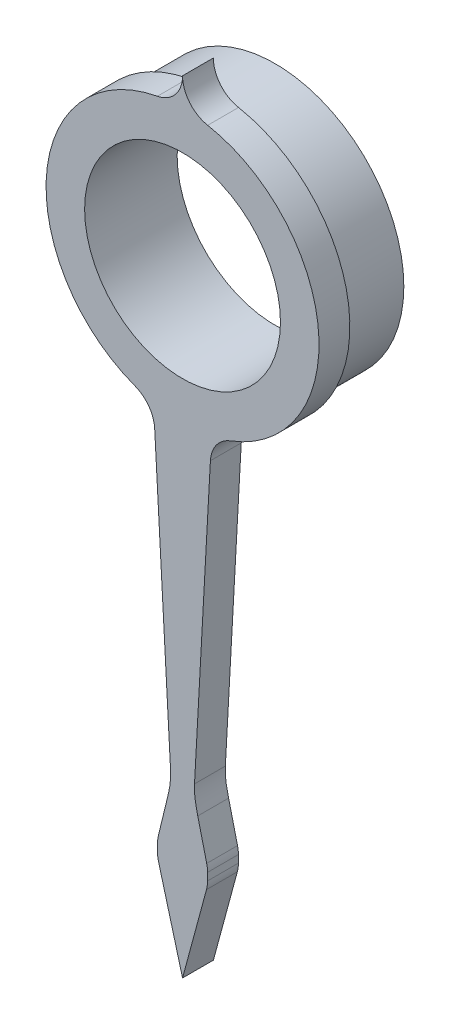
ISO-10303-21;
HEADER;
FILE_DESCRIPTION(('STEP AP214'),'2;1');
FILE_NAME('part.step','',(''),(''),'','','');
FILE_SCHEMA(('AUTOMOTIVE_DESIGN { 1 0 10303 214 1 1 1 1 }'));
ENDSEC;
DATA;
#1=APPLICATION_CONTEXT('core data for automotive mechanical design processes');
#2=APPLICATION_PROTOCOL_DEFINITION('international standard','automotive_design',2000,#1);
#3=PRODUCT_CONTEXT('',#1,'mechanical');
#4=PRODUCT('Part','Part','',(#3));
#5=PRODUCT_RELATED_PRODUCT_CATEGORY('part','',(#4));
#6=PRODUCT_DEFINITION_FORMATION('','',#4);
#7=PRODUCT_DEFINITION_CONTEXT('part definition',#1,'design');
#8=PRODUCT_DEFINITION('design','',#6,#7);
#9=PRODUCT_DEFINITION_SHAPE('','',#8);
#10=(LENGTH_UNIT() NAMED_UNIT(*) SI_UNIT(.MILLI.,.METRE.));
#11=(NAMED_UNIT(*) PLANE_ANGLE_UNIT() SI_UNIT($,.RADIAN.));
#12=(NAMED_UNIT(*) SI_UNIT($,.STERADIAN.) SOLID_ANGLE_UNIT());
#13=UNCERTAINTY_MEASURE_WITH_UNIT(LENGTH_MEASURE(1.E-05),#10,'distance_accuracy_value','');
#14=(GEOMETRIC_REPRESENTATION_CONTEXT(3) GLOBAL_UNCERTAINTY_ASSIGNED_CONTEXT((#13)) GLOBAL_UNIT_ASSIGNED_CONTEXT((#10,
#11,#12)) REPRESENTATION_CONTEXT('',''));
#15=CARTESIAN_POINT('',(0.,0.,0.));
#16=DIRECTION('',(0.,0.,1.));
#17=DIRECTION('',(1.,0.,0.));
#18=AXIS2_PLACEMENT_3D('',#15,#16,#17);
#19=CARTESIAN_POINT('',(1.9017074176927,2.79553884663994,0.));
#20=DIRECTION('',(0.,0.,-1.));
#21=DIRECTION('',(-1.,0.,0.));
#22=AXIS2_PLACEMENT_3D('',#19,#20,#21);
#23=PLANE('',#22);
#24=CARTESIAN_POINT('',(1.9017074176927,2.79553884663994,0.));
#25=DIRECTION('',(0.,0.,-1.));
#26=DIRECTION('',(-1.,0.,0.));
#27=AXIS2_PLACEMENT_3D('',#24,#25,#26);
#28=CIRCLE('',#27,1.);
#29=CARTESIAN_POINT('',(0.903227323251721,2.85065237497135,0.));
#30=VERTEX_POINT('',#29);
#31=CARTESIAN_POINT('',(1.55116227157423,3.73208468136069,0.));
#32=VERTEX_POINT('',#31);
#33=EDGE_CURVE('E353',#30,#32,#28,.T.);
#34=ORIENTED_EDGE('',*,*,#33,.F.);
#35=DIRECTION('',(0.0551135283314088,0.998480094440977,0.));
#36=VECTOR('',#35,1.);
#37=CARTESIAN_POINT('',(0.3881,-6.4818,0.));
#38=LINE('',#37,#36);
#39=CARTESIAN_POINT('',(0.3881,-6.4818,0.));
#40=VERTEX_POINT('',#39);
#41=EDGE_CURVE('E118',#40,#30,#38,.T.);
#42=ORIENTED_EDGE('',*,*,#41,.F.);
#43=CARTESIAN_POINT('',(0.4939,-7.3285,0.));
#44=CARTESIAN_POINT('',(0.424635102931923,-7.04376127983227,0.));
#45=CARTESIAN_POINT('',(0.37105819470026,-6.79054276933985,0.));
#46=CARTESIAN_POINT('',(0.3881,-6.4818,0.));
#47=B_SPLINE_CURVE_WITH_KNOTS('',3,(#43,#44,#45,#46),.UNSPECIFIED.,.F.,.F.,(4,4),(0.,1.),.UNSPECIFIED.);
#48=CARTESIAN_POINT('',(0.4939,-7.3285,0.));
#49=VERTEX_POINT('',#48);
#50=EDGE_CURVE('E112',#49,#40,#47,.T.);
#51=ORIENTED_EDGE('',*,*,#50,.F.);
#52=DIRECTION('',(-0.236364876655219,0.971664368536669,0.));
#53=VECTOR('',#52,1.);
#54=CARTESIAN_POINT('',(0.783064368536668,-8.51721601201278,0.));
#55=LINE('',#54,#53);
#56=CARTESIAN_POINT('',(0.783064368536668,-8.51721601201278,0.));
#57=VERTEX_POINT('',#56);
#58=EDGE_CURVE('E190',#57,#49,#55,.T.);
#59=ORIENTED_EDGE('',*,*,#58,.F.);
#60=CARTESIAN_POINT('',(-0.1886,-8.75358088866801,0.));
#61=DIRECTION('',(0.,0.,1.));
#62=DIRECTION('',(1.,0.,0.));
#63=AXIS2_PLACEMENT_3D('',#60,#61,#62);
#64=CIRCLE('',#63,1.);
#65=CARTESIAN_POINT('',(0.8114,-8.75358088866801,0.));
#66=VERTEX_POINT('',#65);
#67=EDGE_CURVE('E295',#66,#57,#64,.T.);
#68=ORIENTED_EDGE('',*,*,#67,.F.);
#69=DIRECTION('',(0.,1.,0.));
#70=VECTOR('',#69,1.);
#71=CARTESIAN_POINT('',(0.8114,-8.75358088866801,0.));
#72=LINE('',#71,#70);
#73=CARTESIAN_POINT('',(0.8114,-8.99469770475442,0.));
#74=VERTEX_POINT('',#73);
#75=EDGE_CURVE('E291',#74,#66,#72,.T.);
#76=ORIENTED_EDGE('',*,*,#75,.F.);
#77=CARTESIAN_POINT('',(-0.1886,-8.99469770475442,0.));
#78=DIRECTION('',(0.,0.,1.));
#79=DIRECTION('',(1.,0.,0.));
#80=AXIS2_PLACEMENT_3D('',#77,#78,#79);
#81=CIRCLE('',#80,1.);
#82=CARTESIAN_POINT('',(0.776687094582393,-9.25588887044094,0.));
#83=VERTEX_POINT('',#82);
#84=EDGE_CURVE('E380',#83,#74,#81,.T.);
#85=ORIENTED_EDGE('',*,*,#84,.F.);
#86=DIRECTION('',(0.261191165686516,0.965287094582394,0.));
#87=VECTOR('',#86,1.);
#88=CARTESIAN_POINT('',(0.,-12.1263,0.));
#89=LINE('',#88,#87);
#90=CARTESIAN_POINT('',(0.,-12.1263,0.));
#91=VERTEX_POINT('',#90);
#92=EDGE_CURVE('E378',#91,#83,#89,.T.);
#93=ORIENTED_EDGE('',*,*,#92,.F.);
#94=DIRECTION('',(0.261191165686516,-0.965287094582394,0.));
#95=VECTOR('',#94,1.);
#96=CARTESIAN_POINT('',(0.,-12.1263,0.));
#97=LINE('',#96,#95);
#98=CARTESIAN_POINT('',(-0.776687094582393,-9.25588887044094,0.));
#99=VERTEX_POINT('',#98);
#100=EDGE_CURVE('E376',#99,#91,#97,.T.);
#101=ORIENTED_EDGE('',*,*,#100,.F.);
#102=CARTESIAN_POINT('',(0.1886,-8.99469770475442,0.));
#103=DIRECTION('',(0.,0.,1.));
#104=DIRECTION('',(-1.,0.,0.));
#105=AXIS2_PLACEMENT_3D('',#102,#103,#104);
#106=CIRCLE('',#105,1.);
#107=CARTESIAN_POINT('',(-0.8114,-8.99469770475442,0.));
#108=VERTEX_POINT('',#107);
#109=EDGE_CURVE('E374',#108,#99,#106,.T.);
#110=ORIENTED_EDGE('',*,*,#109,.F.);
#111=DIRECTION('',(0.,-1.,0.));
#112=VECTOR('',#111,1.);
#113=CARTESIAN_POINT('',(-0.8114,-8.75358088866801,0.));
#114=LINE('',#113,#112);
#115=CARTESIAN_POINT('',(-0.8114,-8.75358088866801,0.));
#116=VERTEX_POINT('',#115);
#117=EDGE_CURVE('E372',#116,#108,#114,.T.);
#118=ORIENTED_EDGE('',*,*,#117,.F.);
#119=CARTESIAN_POINT('',(0.1886,-8.75358088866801,0.));
#120=DIRECTION('',(0.,0.,1.));
#121=DIRECTION('',(-1.,0.,0.));
#122=AXIS2_PLACEMENT_3D('',#119,#120,#121);
#123=CIRCLE('',#122,1.);
#124=CARTESIAN_POINT('',(-0.783064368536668,-8.51721601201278,0.));
#125=VERTEX_POINT('',#124);
#126=EDGE_CURVE('E370',#125,#116,#123,.T.);
#127=ORIENTED_EDGE('',*,*,#126,.F.);
#128=DIRECTION('',(-0.236364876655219,-0.971664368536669,0.));
#129=VECTOR('',#128,1.);
#130=CARTESIAN_POINT('',(-0.783064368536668,-8.51721601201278,0.));
#131=LINE('',#130,#129);
#132=CARTESIAN_POINT('',(-0.4939,-7.3285,0.));
#133=VERTEX_POINT('',#132);
#134=EDGE_CURVE('E365',#133,#125,#131,.T.);
#135=ORIENTED_EDGE('',*,*,#134,.F.);
#136=CARTESIAN_POINT('',(-0.388099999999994,-6.4818,0.));
#137=CARTESIAN_POINT('',(-0.371058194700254,-6.79054276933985,0.));
#138=CARTESIAN_POINT('',(-0.424635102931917,-7.04376127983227,0.));
#139=CARTESIAN_POINT('',(-0.493899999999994,-7.3285,0.));
#140=B_SPLINE_CURVE_WITH_KNOTS('',3,(#136,#137,#138,#139),.UNSPECIFIED.,.F.,.F.,(4,4),(0.,1.),.UNSPECIFIED.);
#141=CARTESIAN_POINT('',(-0.388099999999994,-6.4818,0.));
#142=VERTEX_POINT('',#141);
#143=EDGE_CURVE('E361',#142,#133,#140,.T.);
#144=ORIENTED_EDGE('',*,*,#143,.F.);
#145=DIRECTION('',(0.0551135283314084,-0.998480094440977,0.));
#146=VECTOR('',#145,1.);
#147=CARTESIAN_POINT('',(-0.3881,-6.4818,0.));
#148=LINE('',#147,#146);
#149=CARTESIAN_POINT('',(-0.903227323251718,2.85065237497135,0.));
#150=VERTEX_POINT('',#149);
#151=EDGE_CURVE('E359',#150,#142,#148,.T.);
#152=ORIENTED_EDGE('',*,*,#151,.F.);
#153=CARTESIAN_POINT('',(-1.90170741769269,2.79553884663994,0.));
#154=DIRECTION('',(0.,0.,-1.));
#155=DIRECTION('',(1.,0.,0.));
#156=AXIS2_PLACEMENT_3D('',#153,#154,#155);
#157=CIRCLE('',#156,1.);
#158=CARTESIAN_POINT('',(-1.55116227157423,3.73208468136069,0.));
#159=VERTEX_POINT('',#158);
#160=EDGE_CURVE('E357',#159,#150,#157,.T.);
#161=ORIENTED_EDGE('',*,*,#160,.F.);
#162=CARTESIAN_POINT('',(0.,7.8763,0.));
#163=DIRECTION('',(0.,0.,1.));
#164=DIRECTION('',(1.,0.,0.));
#165=AXIS2_PLACEMENT_3D('',#162,#163,#164);
#166=CIRCLE('',#165,4.425);
#167=CARTESIAN_POINT('',(-0.815668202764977,12.2254735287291,0.));
#168=VERTEX_POINT('',#167);
#169=EDGE_CURVE('E351',#168,#159,#166,.T.);
#170=ORIENTED_EDGE('',*,*,#169,.F.);
#171=CARTESIAN_POINT('',(-1.,13.2083376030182,0.));
#172=DIRECTION('',(0.,0.,-1.));
#173=DIRECTION('',(-1.,0.,0.));
#174=AXIS2_PLACEMENT_3D('',#171,#172,#173);
#175=CIRCLE('',#174,1.);
#176=CARTESIAN_POINT('',(0.,13.2083376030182,0.));
#177=VERTEX_POINT('',#176);
#178=EDGE_CURVE('E349',#177,#168,#175,.T.);
#179=ORIENTED_EDGE('',*,*,#178,.F.);
#180=CARTESIAN_POINT('',(1.,13.2083376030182,0.));
#181=DIRECTION('',(0.,0.,-1.));
#182=DIRECTION('',(1.,0.,0.));
#183=AXIS2_PLACEMENT_3D('',#180,#181,#182);
#184=CIRCLE('',#183,1.);
#185=CARTESIAN_POINT('',(0.815668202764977,12.2254735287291,0.));
#186=VERTEX_POINT('',#185);
#187=EDGE_CURVE('E341',#186,#177,#184,.T.);
#188=ORIENTED_EDGE('',*,*,#187,.F.);
#189=CARTESIAN_POINT('',(0.,7.8763,0.));
#190=DIRECTION('',(0.,0.,1.));
#191=DIRECTION('',(1.,0.,0.));
#192=AXIS2_PLACEMENT_3D('',#189,#190,#191);
#193=CIRCLE('',#192,4.425);
#194=EDGE_CURVE('E347',#32,#186,#193,.T.);
#195=ORIENTED_EDGE('',*,*,#194,.F.);
#196=EDGE_LOOP('',(#34,#42,#51,#59,#68,#76,#85,#93,#101,#110,#118,#127,#135,#144,#152,#161,#170,
#179,#188,#195));
#197=FACE_BOUND('',#196,.T.);
#198=CARTESIAN_POINT('',(0.,7.8763,0.));
#199=DIRECTION('',(0.,0.,-1.));
#200=DIRECTION('',(-1.,0.,0.));
#201=AXIS2_PLACEMENT_3D('',#198,#199,#200);
#202=CIRCLE('',#201,4.175);
#203=CARTESIAN_POINT('',(-4.175,7.8763,0.));
#204=VERTEX_POINT('',#203);
#205=EDGE_CURVE('E403',#204,#204,#202,.T.);
#206=ORIENTED_EDGE('',*,*,#205,.F.);
#207=EDGE_LOOP('',(#206));
#208=FACE_BOUND('',#207,.T.);
#209=ADVANCED_FACE('F30',(#197,#208),#23,.T.);
#210=CARTESIAN_POINT('',(1.9017074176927,2.79553884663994,1.));
#211=DIRECTION('',(0.,0.,-1.));
#212=DIRECTION('',(-1.,0.,0.));
#213=AXIS2_PLACEMENT_3D('',#210,#211,#212);
#214=PLANE('',#213);
#215=CARTESIAN_POINT('',(1.9017074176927,2.79553884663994,1.));
#216=DIRECTION('',(0.,0.,-1.));
#217=DIRECTION('',(-1.,0.,0.));
#218=AXIS2_PLACEMENT_3D('',#215,#216,#217);
#219=CIRCLE('',#218,1.);
#220=CARTESIAN_POINT('',(0.903227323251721,2.85065237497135,1.));
#221=VERTEX_POINT('',#220);
#222=CARTESIAN_POINT('',(1.55116227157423,3.73208468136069,1.));
#223=VERTEX_POINT('',#222);
#224=EDGE_CURVE('E392',#221,#223,#219,.T.);
#225=ORIENTED_EDGE('',*,*,#224,.T.);
#226=CARTESIAN_POINT('',(0.,7.8763,1.));
#227=DIRECTION('',(0.,0.,1.));
#228=DIRECTION('',(1.,0.,0.));
#229=AXIS2_PLACEMENT_3D('',#226,#227,#228);
#230=CIRCLE('',#229,4.425);
#231=CARTESIAN_POINT('',(0.815668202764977,12.2254735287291,1.));
#232=VERTEX_POINT('',#231);
#233=EDGE_CURVE('E126',#223,#232,#230,.T.);
#234=ORIENTED_EDGE('',*,*,#233,.T.);
#235=CARTESIAN_POINT('',(1.,13.2083376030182,1.));
#236=DIRECTION('',(0.,0.,-1.));
#237=DIRECTION('',(1.,0.,0.));
#238=AXIS2_PLACEMENT_3D('',#235,#236,#237);
#239=CIRCLE('',#238,1.);
#240=CARTESIAN_POINT('',(0.,13.2083376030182,1.));
#241=VERTEX_POINT('',#240);
#242=EDGE_CURVE('E342',#232,#241,#239,.T.);
#243=ORIENTED_EDGE('',*,*,#242,.T.);
#244=CARTESIAN_POINT('',(-1.,13.2083376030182,1.));
#245=DIRECTION('',(0.,0.,-1.));
#246=DIRECTION('',(-1.,0.,0.));
#247=AXIS2_PLACEMENT_3D('',#244,#245,#246);
#248=CIRCLE('',#247,1.);
#249=CARTESIAN_POINT('',(-0.815668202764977,12.2254735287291,1.));
#250=VERTEX_POINT('',#249);
#251=EDGE_CURVE('E410',#241,#250,#248,.T.);
#252=ORIENTED_EDGE('',*,*,#251,.T.);
#253=CARTESIAN_POINT('',(0.,7.8763,1.));
#254=DIRECTION('',(0.,0.,1.));
#255=DIRECTION('',(1.,0.,0.));
#256=AXIS2_PLACEMENT_3D('',#253,#254,#255);
#257=CIRCLE('',#256,4.425);
#258=CARTESIAN_POINT('',(-1.55116227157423,3.73208468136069,1.));
#259=VERTEX_POINT('',#258);
#260=EDGE_CURVE('E412',#250,#259,#257,.T.);
#261=ORIENTED_EDGE('',*,*,#260,.T.);
#262=CARTESIAN_POINT('',(-1.90170741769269,2.79553884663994,1.));
#263=DIRECTION('',(0.,0.,-1.));
#264=DIRECTION('',(1.,0.,0.));
#265=AXIS2_PLACEMENT_3D('',#262,#263,#264);
#266=CIRCLE('',#265,1.);
#267=CARTESIAN_POINT('',(-0.903227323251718,2.85065237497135,1.));
#268=VERTEX_POINT('',#267);
#269=EDGE_CURVE('E413',#259,#268,#266,.T.);
#270=ORIENTED_EDGE('',*,*,#269,.T.);
#271=DIRECTION('',(0.0551135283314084,-0.998480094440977,0.));
#272=VECTOR('',#271,1.);
#273=CARTESIAN_POINT('',(-0.3881,-6.4818,1.));
#274=LINE('',#273,#272);
#275=CARTESIAN_POINT('',(-0.388099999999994,-6.4818,1.));
#276=VERTEX_POINT('',#275);
#277=EDGE_CURVE('E264',#268,#276,#274,.T.);
#278=ORIENTED_EDGE('',*,*,#277,.T.);
#279=CARTESIAN_POINT('',(-0.388099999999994,-6.4818,1.));
#280=CARTESIAN_POINT('',(-0.371058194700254,-6.79054276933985,1.));
#281=CARTESIAN_POINT('',(-0.424635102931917,-7.04376127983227,1.));
#282=CARTESIAN_POINT('',(-0.493899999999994,-7.3285,1.));
#283=B_SPLINE_CURVE_WITH_KNOTS('',3,(#279,#280,#281,#282),.UNSPECIFIED.,.F.,.F.,(4,4),(0.,1.),.UNSPECIFIED.);
#284=CARTESIAN_POINT('',(-0.4939,-7.3285,1.));
#285=VERTEX_POINT('',#284);
#286=EDGE_CURVE('E257',#276,#285,#283,.T.);
#287=ORIENTED_EDGE('',*,*,#286,.T.);
#288=DIRECTION('',(-0.236364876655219,-0.971664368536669,0.));
#289=VECTOR('',#288,1.);
#290=CARTESIAN_POINT('',(-0.783064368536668,-8.51721601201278,1.));
#291=LINE('',#290,#289);
#292=CARTESIAN_POINT('',(-0.783064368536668,-8.51721601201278,1.));
#293=VERTEX_POINT('',#292);
#294=EDGE_CURVE('E263',#285,#293,#291,.T.);
#295=ORIENTED_EDGE('',*,*,#294,.T.);
#296=CARTESIAN_POINT('',(0.1886,-8.75358088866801,1.));
#297=DIRECTION('',(0.,0.,1.));
#298=DIRECTION('',(-1.,0.,0.));
#299=AXIS2_PLACEMENT_3D('',#296,#297,#298);
#300=CIRCLE('',#299,1.);
#301=CARTESIAN_POINT('',(-0.8114,-8.75358088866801,1.));
#302=VERTEX_POINT('',#301);
#303=EDGE_CURVE('E270',#293,#302,#300,.T.);
#304=ORIENTED_EDGE('',*,*,#303,.T.);
#305=DIRECTION('',(0.,-1.,0.));
#306=VECTOR('',#305,1.);
#307=CARTESIAN_POINT('',(-0.8114,-8.75358088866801,1.));
#308=LINE('',#307,#306);
#309=CARTESIAN_POINT('',(-0.8114,-8.99469770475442,1.));
#310=VERTEX_POINT('',#309);
#311=EDGE_CURVE('E272',#302,#310,#308,.T.);
#312=ORIENTED_EDGE('',*,*,#311,.T.);
#313=CARTESIAN_POINT('',(0.1886,-8.99469770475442,1.));
#314=DIRECTION('',(0.,0.,1.));
#315=DIRECTION('',(-1.,0.,0.));
#316=AXIS2_PLACEMENT_3D('',#313,#314,#315);
#317=CIRCLE('',#316,1.);
#318=CARTESIAN_POINT('',(-0.776687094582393,-9.25588887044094,1.));
#319=VERTEX_POINT('',#318);
#320=EDGE_CURVE('E274',#310,#319,#317,.T.);
#321=ORIENTED_EDGE('',*,*,#320,.T.);
#322=DIRECTION('',(0.261191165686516,-0.965287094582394,0.));
#323=VECTOR('',#322,1.);
#324=CARTESIAN_POINT('',(0.,-12.1263,1.));
#325=LINE('',#324,#323);
#326=CARTESIAN_POINT('',(0.,-12.1263,1.));
#327=VERTEX_POINT('',#326);
#328=EDGE_CURVE('E276',#319,#327,#325,.T.);
#329=ORIENTED_EDGE('',*,*,#328,.T.);
#330=DIRECTION('',(0.261191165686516,0.965287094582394,0.));
#331=VECTOR('',#330,1.);
#332=CARTESIAN_POINT('',(0.,-12.1263,1.));
#333=LINE('',#332,#331);
#334=CARTESIAN_POINT('',(0.776687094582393,-9.25588887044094,1.));
#335=VERTEX_POINT('',#334);
#336=EDGE_CURVE('E278',#327,#335,#333,.T.);
#337=ORIENTED_EDGE('',*,*,#336,.T.);
#338=CARTESIAN_POINT('',(-0.1886,-8.99469770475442,1.));
#339=DIRECTION('',(0.,0.,1.));
#340=DIRECTION('',(1.,0.,0.));
#341=AXIS2_PLACEMENT_3D('',#338,#339,#340);
#342=CIRCLE('',#341,1.);
#343=CARTESIAN_POINT('',(0.8114,-8.99469770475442,1.));
#344=VERTEX_POINT('',#343);
#345=EDGE_CURVE('E280',#335,#344,#342,.T.);
#346=ORIENTED_EDGE('',*,*,#345,.T.);
#347=DIRECTION('',(0.,1.,0.));
#348=VECTOR('',#347,1.);
#349=CARTESIAN_POINT('',(0.8114,-8.75358088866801,1.));
#350=LINE('',#349,#348);
#351=CARTESIAN_POINT('',(0.8114,-8.75358088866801,1.));
#352=VERTEX_POINT('',#351);
#353=EDGE_CURVE('E282',#344,#352,#350,.T.);
#354=ORIENTED_EDGE('',*,*,#353,.T.);
#355=CARTESIAN_POINT('',(-0.1886,-8.75358088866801,1.));
#356=DIRECTION('',(0.,0.,1.));
#357=DIRECTION('',(1.,0.,0.));
#358=AXIS2_PLACEMENT_3D('',#355,#356,#357);
#359=CIRCLE('',#358,1.);
#360=CARTESIAN_POINT('',(0.783064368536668,-8.51721601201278,1.));
#361=VERTEX_POINT('',#360);
#362=EDGE_CURVE('E182',#352,#361,#359,.T.);
#363=ORIENTED_EDGE('',*,*,#362,.T.);
#364=DIRECTION('',(-0.236364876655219,0.971664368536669,0.));
#365=VECTOR('',#364,1.);
#366=CARTESIAN_POINT('',(0.783064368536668,-8.51721601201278,1.));
#367=LINE('',#366,#365);
#368=CARTESIAN_POINT('',(0.4939,-7.3285,1.));
#369=VERTEX_POINT('',#368);
#370=EDGE_CURVE('E175',#361,#369,#367,.T.);
#371=ORIENTED_EDGE('',*,*,#370,.T.);
#372=CARTESIAN_POINT('',(0.4939,-7.3285,1.));
#373=CARTESIAN_POINT('',(0.424635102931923,-7.04376127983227,1.));
#374=CARTESIAN_POINT('',(0.37105819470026,-6.79054276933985,1.));
#375=CARTESIAN_POINT('',(0.3881,-6.4818,1.));
#376=B_SPLINE_CURVE_WITH_KNOTS('',3,(#372,#373,#374,#375),.UNSPECIFIED.,.F.,.F.,(4,4),(0.,1.),.UNSPECIFIED.);
#377=CARTESIAN_POINT('',(0.3881,-6.4818,1.));
#378=VERTEX_POINT('',#377);
#379=EDGE_CURVE('E180',#369,#378,#376,.T.);
#380=ORIENTED_EDGE('',*,*,#379,.T.);
#381=DIRECTION('',(0.0551135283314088,0.998480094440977,0.));
#382=VECTOR('',#381,1.);
#383=CARTESIAN_POINT('',(0.3881,-6.4818,1.));
#384=LINE('',#383,#382);
#385=EDGE_CURVE('E47',#378,#221,#384,.T.);
#386=ORIENTED_EDGE('',*,*,#385,.T.);
#387=EDGE_LOOP('',(#225,#234,#243,#252,#261,#270,#278,#287,#295,#304,#312,#321,#329,#337,#346,
#354,#363,#371,#380,#386));
#388=FACE_BOUND('',#387,.T.);
#389=CARTESIAN_POINT('',(0.,7.8763,1.));
#390=DIRECTION('',(0.,0.,1.));
#391=DIRECTION('',(1.,0.,0.));
#392=AXIS2_PLACEMENT_3D('',#389,#390,#391);
#393=CIRCLE('',#392,3.175);
#394=CARTESIAN_POINT('',(3.175,7.8763,1.));
#395=VERTEX_POINT('',#394);
#396=EDGE_CURVE('E396',#395,#395,#393,.T.);
#397=ORIENTED_EDGE('',*,*,#396,.F.);
#398=EDGE_LOOP('',(#397));
#399=FACE_BOUND('',#398,.T.);
#400=ADVANCED_FACE('F177',(#388,#399),#214,.F.);
#401=CARTESIAN_POINT('',(1.9017074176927,2.79553884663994,1.));
#402=DIRECTION('',(0.,0.,-1.));
#403=DIRECTION('',(-1.,0.,0.));
#404=AXIS2_PLACEMENT_3D('',#401,#402,#403);
#405=CYLINDRICAL_SURFACE('',#404,1.);
#406=ORIENTED_EDGE('',*,*,#33,.T.);
#407=DIRECTION('',(0.,0.,-1.));
#408=VECTOR('',#407,1.);
#409=CARTESIAN_POINT('',(1.55116227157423,3.73208468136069,1.));
#410=LINE('',#409,#408);
#411=EDGE_CURVE('E11',#223,#32,#410,.T.);
#412=ORIENTED_EDGE('',*,*,#411,.F.);
#413=ORIENTED_EDGE('',*,*,#224,.F.);
#414=DIRECTION('',(0.,0.,-1.));
#415=VECTOR('',#414,1.);
#416=CARTESIAN_POINT('',(0.903227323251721,2.85065237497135,1.));
#417=LINE('',#416,#415);
#418=EDGE_CURVE('E196',#221,#30,#417,.T.);
#419=ORIENTED_EDGE('',*,*,#418,.T.);
#420=EDGE_LOOP('',(#406,#412,#413,#419));
#421=FACE_BOUND('',#420,.T.);
#422=ADVANCED_FACE('F32',(#421),#405,.F.);
#423=CARTESIAN_POINT('',(0.,7.8763,1.));
#424=DIRECTION('',(0.,0.,-1.));
#425=DIRECTION('',(-1.,0.,0.));
#426=AXIS2_PLACEMENT_3D('',#423,#424,#425);
#427=CYLINDRICAL_SURFACE('',#426,4.425);
#428=ORIENTED_EDGE('',*,*,#194,.T.);
#429=DIRECTION('',(0.,0.,-1.));
#430=VECTOR('',#429,1.);
#431=CARTESIAN_POINT('',(0.815668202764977,12.2254735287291,1.));
#432=LINE('',#431,#430);
#433=EDGE_CURVE('E39',#232,#186,#432,.T.);
#434=ORIENTED_EDGE('',*,*,#433,.F.);
#435=ORIENTED_EDGE('',*,*,#233,.F.);
#436=ORIENTED_EDGE('',*,*,#411,.T.);
#437=EDGE_LOOP('',(#428,#434,#435,#436));
#438=FACE_BOUND('',#437,.T.);
#439=ADVANCED_FACE('F454',(#438),#427,.T.);
#440=CARTESIAN_POINT('',(1.,13.2083376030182,1.));
#441=DIRECTION('',(0.,0.,-1.));
#442=DIRECTION('',(-1.,0.,0.));
#443=AXIS2_PLACEMENT_3D('',#440,#441,#442);
#444=CYLINDRICAL_SURFACE('',#443,1.);
#445=ORIENTED_EDGE('',*,*,#187,.T.);
#446=DIRECTION('',(0.,0.,-1.));
#447=VECTOR('',#446,1.);
#448=CARTESIAN_POINT('',(0.,13.2083376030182,1.));
#449=LINE('',#448,#447);
#450=EDGE_CURVE('E333',#241,#177,#449,.T.);
#451=ORIENTED_EDGE('',*,*,#450,.F.);
#452=ORIENTED_EDGE('',*,*,#242,.F.);
#453=ORIENTED_EDGE('',*,*,#433,.T.);
#454=EDGE_LOOP('',(#445,#451,#452,#453));
#455=FACE_BOUND('',#454,.T.);
#456=ADVANCED_FACE('F339',(#455),#444,.F.);
#457=CARTESIAN_POINT('',(-1.,13.2083376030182,1.));
#458=DIRECTION('',(0.,0.,-1.));
#459=DIRECTION('',(-1.,0.,0.));
#460=AXIS2_PLACEMENT_3D('',#457,#458,#459);
#461=CYLINDRICAL_SURFACE('',#460,1.);
#462=ORIENTED_EDGE('',*,*,#178,.T.);
#463=DIRECTION('',(0.,0.,-1.));
#464=VECTOR('',#463,1.);
#465=CARTESIAN_POINT('',(-0.815668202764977,12.2254735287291,1.));
#466=LINE('',#465,#464);
#467=EDGE_CURVE('E330',#250,#168,#466,.T.);
#468=ORIENTED_EDGE('',*,*,#467,.F.);
#469=ORIENTED_EDGE('',*,*,#251,.F.);
#470=ORIENTED_EDGE('',*,*,#450,.T.);
#471=EDGE_LOOP('',(#462,#468,#469,#470));
#472=FACE_BOUND('',#471,.T.);
#473=ADVANCED_FACE('F452',(#472),#461,.F.);
#474=CARTESIAN_POINT('',(0.,7.8763,1.));
#475=DIRECTION('',(0.,0.,-1.));
#476=DIRECTION('',(-1.,0.,0.));
#477=AXIS2_PLACEMENT_3D('',#474,#475,#476);
#478=CYLINDRICAL_SURFACE('',#477,4.425);
#479=ORIENTED_EDGE('',*,*,#169,.T.);
#480=DIRECTION('',(0.,0.,-1.));
#481=VECTOR('',#480,1.);
#482=CARTESIAN_POINT('',(-1.55116227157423,3.73208468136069,1.));
#483=LINE('',#482,#481);
#484=EDGE_CURVE('E327',#259,#159,#483,.T.);
#485=ORIENTED_EDGE('',*,*,#484,.F.);
#486=ORIENTED_EDGE('',*,*,#260,.F.);
#487=ORIENTED_EDGE('',*,*,#467,.T.);
#488=EDGE_LOOP('',(#479,#485,#486,#487));
#489=FACE_BOUND('',#488,.T.);
#490=ADVANCED_FACE('F448',(#489),#478,.T.);
#491=CARTESIAN_POINT('',(-1.90170741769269,2.79553884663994,1.));
#492=DIRECTION('',(0.,0.,-1.));
#493=DIRECTION('',(-1.,0.,0.));
#494=AXIS2_PLACEMENT_3D('',#491,#492,#493);
#495=CYLINDRICAL_SURFACE('',#494,1.);
#496=ORIENTED_EDGE('',*,*,#160,.T.);
#497=DIRECTION('',(0.,0.,-1.));
#498=VECTOR('',#497,1.);
#499=CARTESIAN_POINT('',(-0.903227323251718,2.85065237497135,1.));
#500=LINE('',#499,#498);
#501=EDGE_CURVE('E324',#268,#150,#500,.T.);
#502=ORIENTED_EDGE('',*,*,#501,.F.);
#503=ORIENTED_EDGE('',*,*,#269,.F.);
#504=ORIENTED_EDGE('',*,*,#484,.T.);
#505=EDGE_LOOP('',(#496,#502,#503,#504));
#506=FACE_BOUND('',#505,.T.);
#507=ADVANCED_FACE('F444',(#506),#495,.F.);
#508=CARTESIAN_POINT('',(-0.3881,-6.4818,1.));
#509=DIRECTION('',(0.998480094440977,0.0551135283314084,0.));
#510=DIRECTION('',(-0.0551135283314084,0.998480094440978,0.));
#511=AXIS2_PLACEMENT_3D('',#508,#509,#510);
#512=PLANE('',#511);
#513=ORIENTED_EDGE('',*,*,#151,.T.);
#514=DIRECTION('',(0.,0.,-1.));
#515=VECTOR('',#514,1.);
#516=CARTESIAN_POINT('',(-0.388099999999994,-6.4818,1.));
#517=LINE('',#516,#515);
#518=EDGE_CURVE('E321',#276,#142,#517,.T.);
#519=ORIENTED_EDGE('',*,*,#518,.F.);
#520=ORIENTED_EDGE('',*,*,#277,.F.);
#521=ORIENTED_EDGE('',*,*,#501,.T.);
#522=EDGE_LOOP('',(#513,#519,#520,#521));
#523=FACE_BOUND('',#522,.T.);
#524=ADVANCED_FACE('F254',(#523),#512,.F.);
#525=DIRECTION('',(0.,0.,-1.));
#526=VECTOR('',#525,1.);
#527=SURFACE_OF_LINEAR_EXTRUSION('',#283,#526);
#528=ORIENTED_EDGE('',*,*,#143,.T.);
#529=DIRECTION('',(0.,0.,-1.));
#530=VECTOR('',#529,1.);
#531=CARTESIAN_POINT('',(-0.4939,-7.3285,1.));
#532=LINE('',#531,#530);
#533=EDGE_CURVE('E318',#285,#133,#532,.T.);
#534=ORIENTED_EDGE('',*,*,#533,.F.);
#535=ORIENTED_EDGE('',*,*,#286,.F.);
#536=ORIENTED_EDGE('',*,*,#518,.T.);
#537=EDGE_LOOP('',(#528,#534,#535,#536));
#538=FACE_BOUND('',#537,.T.);
#539=ADVANCED_FACE('F249',(#538),#527,.F.);
#540=CARTESIAN_POINT('',(-0.783064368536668,-8.51721601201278,1.));
#541=DIRECTION('',(0.971664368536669,-0.236364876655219,0.));
#542=DIRECTION('',(0.236364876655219,0.971664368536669,0.));
#543=AXIS2_PLACEMENT_3D('',#540,#541,#542);
#544=PLANE('',#543);
#545=ORIENTED_EDGE('',*,*,#134,.T.);
#546=DIRECTION('',(0.,0.,-1.));
#547=VECTOR('',#546,1.);
#548=CARTESIAN_POINT('',(-0.783064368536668,-8.51721601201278,1.));
#549=LINE('',#548,#547);
#550=EDGE_CURVE('E315',#293,#125,#549,.T.);
#551=ORIENTED_EDGE('',*,*,#550,.F.);
#552=ORIENTED_EDGE('',*,*,#294,.F.);
#553=ORIENTED_EDGE('',*,*,#533,.T.);
#554=EDGE_LOOP('',(#545,#551,#552,#553));
#555=FACE_BOUND('',#554,.T.);
#556=ADVANCED_FACE('F245',(#555),#544,.F.);
#557=CARTESIAN_POINT('',(0.1886,-8.75358088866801,1.));
#558=DIRECTION('',(0.,0.,-1.));
#559=DIRECTION('',(-1.,0.,0.));
#560=AXIS2_PLACEMENT_3D('',#557,#558,#559);
#561=CYLINDRICAL_SURFACE('',#560,1.);
#562=ORIENTED_EDGE('',*,*,#126,.T.);
#563=DIRECTION('',(0.,0.,-1.));
#564=VECTOR('',#563,1.);
#565=CARTESIAN_POINT('',(-0.8114,-8.75358088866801,1.));
#566=LINE('',#565,#564);
#567=EDGE_CURVE('E312',#302,#116,#566,.T.);
#568=ORIENTED_EDGE('',*,*,#567,.F.);
#569=ORIENTED_EDGE('',*,*,#303,.F.);
#570=ORIENTED_EDGE('',*,*,#550,.T.);
#571=EDGE_LOOP('',(#562,#568,#569,#570));
#572=FACE_BOUND('',#571,.T.);
#573=ADVANCED_FACE('F241',(#572),#561,.T.);
#574=CARTESIAN_POINT('',(-0.8114,-8.75358088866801,1.));
#575=DIRECTION('',(1.,0.,0.));
#576=DIRECTION('',(0.,0.,-1.));
#577=AXIS2_PLACEMENT_3D('',#574,#575,#576);
#578=PLANE('',#577);
#579=ORIENTED_EDGE('',*,*,#117,.T.);
#580=DIRECTION('',(0.,0.,-1.));
#581=VECTOR('',#580,1.);
#582=CARTESIAN_POINT('',(-0.8114,-8.99469770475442,1.));
#583=LINE('',#582,#581);
#584=EDGE_CURVE('E309',#310,#108,#583,.T.);
#585=ORIENTED_EDGE('',*,*,#584,.F.);
#586=ORIENTED_EDGE('',*,*,#311,.F.);
#587=ORIENTED_EDGE('',*,*,#567,.T.);
#588=EDGE_LOOP('',(#579,#585,#586,#587));
#589=FACE_BOUND('',#588,.T.);
#590=ADVANCED_FACE('F237',(#589),#578,.F.);
#591=CARTESIAN_POINT('',(0.1886,-8.99469770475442,1.));
#592=DIRECTION('',(0.,0.,-1.));
#593=DIRECTION('',(-1.,0.,0.));
#594=AXIS2_PLACEMENT_3D('',#591,#592,#593);
#595=CYLINDRICAL_SURFACE('',#594,1.);
#596=ORIENTED_EDGE('',*,*,#109,.T.);
#597=DIRECTION('',(0.,0.,-1.));
#598=VECTOR('',#597,1.);
#599=CARTESIAN_POINT('',(-0.776687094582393,-9.25588887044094,1.));
#600=LINE('',#599,#598);
#601=EDGE_CURVE('E306',#319,#99,#600,.T.);
#602=ORIENTED_EDGE('',*,*,#601,.F.);
#603=ORIENTED_EDGE('',*,*,#320,.F.);
#604=ORIENTED_EDGE('',*,*,#584,.T.);
#605=EDGE_LOOP('',(#596,#602,#603,#604));
#606=FACE_BOUND('',#605,.T.);
#607=ADVANCED_FACE('F233',(#606),#595,.T.);
#608=CARTESIAN_POINT('',(0.,-12.1263,1.));
#609=DIRECTION('',(0.965287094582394,0.261191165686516,0.));
#610=DIRECTION('',(-0.261191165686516,0.965287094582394,0.));
#611=AXIS2_PLACEMENT_3D('',#608,#609,#610);
#612=PLANE('',#611);
#613=ORIENTED_EDGE('',*,*,#100,.T.);
#614=DIRECTION('',(0.,0.,-1.));
#615=VECTOR('',#614,1.);
#616=CARTESIAN_POINT('',(0.,-12.1263,1.));
#617=LINE('',#616,#615);
#618=EDGE_CURVE('E303',#327,#91,#617,.T.);
#619=ORIENTED_EDGE('',*,*,#618,.F.);
#620=ORIENTED_EDGE('',*,*,#328,.F.);
#621=ORIENTED_EDGE('',*,*,#601,.T.);
#622=EDGE_LOOP('',(#613,#619,#620,#621));
#623=FACE_BOUND('',#622,.T.);
#624=ADVANCED_FACE('F229',(#623),#612,.F.);
#625=CARTESIAN_POINT('',(0.,-12.1263,1.));
#626=DIRECTION('',(-0.965287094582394,0.261191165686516,0.));
#627=DIRECTION('',(-0.261191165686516,-0.965287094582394,0.));
#628=AXIS2_PLACEMENT_3D('',#625,#626,#627);
#629=PLANE('',#628);
#630=ORIENTED_EDGE('',*,*,#92,.T.);
#631=DIRECTION('',(0.,0.,-1.));
#632=VECTOR('',#631,1.);
#633=CARTESIAN_POINT('',(0.776687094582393,-9.25588887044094,1.));
#634=LINE('',#633,#632);
#635=EDGE_CURVE('E300',#335,#83,#634,.T.);
#636=ORIENTED_EDGE('',*,*,#635,.F.);
#637=ORIENTED_EDGE('',*,*,#336,.F.);
#638=ORIENTED_EDGE('',*,*,#618,.T.);
#639=EDGE_LOOP('',(#630,#636,#637,#638));
#640=FACE_BOUND('',#639,.T.);
#641=ADVANCED_FACE('F225',(#640),#629,.F.);
#642=CARTESIAN_POINT('',(-0.1886,-8.99469770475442,1.));
#643=DIRECTION('',(0.,0.,-1.));
#644=DIRECTION('',(-1.,0.,0.));
#645=AXIS2_PLACEMENT_3D('',#642,#643,#644);
#646=CYLINDRICAL_SURFACE('',#645,1.);
#647=ORIENTED_EDGE('',*,*,#84,.T.);
#648=DIRECTION('',(0.,0.,-1.));
#649=VECTOR('',#648,1.);
#650=CARTESIAN_POINT('',(0.8114,-8.99469770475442,1.));
#651=LINE('',#650,#649);
#652=EDGE_CURVE('E293',#344,#74,#651,.T.);
#653=ORIENTED_EDGE('',*,*,#652,.F.);
#654=ORIENTED_EDGE('',*,*,#345,.F.);
#655=ORIENTED_EDGE('',*,*,#635,.T.);
#656=EDGE_LOOP('',(#647,#653,#654,#655));
#657=FACE_BOUND('',#656,.T.);
#658=ADVANCED_FACE('F221',(#657),#646,.T.);
#659=CARTESIAN_POINT('',(0.8114,-8.75358088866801,1.));
#660=DIRECTION('',(-1.,0.,0.));
#661=DIRECTION('',(0.,0.,1.));
#662=AXIS2_PLACEMENT_3D('',#659,#660,#661);
#663=PLANE('',#662);
#664=ORIENTED_EDGE('',*,*,#75,.T.);
#665=DIRECTION('',(0.,0.,-1.));
#666=VECTOR('',#665,1.);
#667=CARTESIAN_POINT('',(0.8114,-8.75358088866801,1.));
#668=LINE('',#667,#666);
#669=EDGE_CURVE('E289',#352,#66,#668,.T.);
#670=ORIENTED_EDGE('',*,*,#669,.F.);
#671=ORIENTED_EDGE('',*,*,#353,.F.);
#672=ORIENTED_EDGE('',*,*,#652,.T.);
#673=EDGE_LOOP('',(#664,#670,#671,#672));
#674=FACE_BOUND('',#673,.T.);
#675=ADVANCED_FACE('F217',(#674),#663,.F.);
#676=CARTESIAN_POINT('',(-0.1886,-8.75358088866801,1.));
#677=DIRECTION('',(0.,0.,-1.));
#678=DIRECTION('',(-1.,0.,0.));
#679=AXIS2_PLACEMENT_3D('',#676,#677,#678);
#680=CYLINDRICAL_SURFACE('',#679,1.);
#681=ORIENTED_EDGE('',*,*,#67,.T.);
#682=DIRECTION('',(0.,0.,-1.));
#683=VECTOR('',#682,1.);
#684=CARTESIAN_POINT('',(0.783064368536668,-8.51721601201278,1.));
#685=LINE('',#684,#683);
#686=EDGE_CURVE('E191',#361,#57,#685,.T.);
#687=ORIENTED_EDGE('',*,*,#686,.F.);
#688=ORIENTED_EDGE('',*,*,#362,.F.);
#689=ORIENTED_EDGE('',*,*,#669,.T.);
#690=EDGE_LOOP('',(#681,#687,#688,#689));
#691=FACE_BOUND('',#690,.T.);
#692=ADVANCED_FACE('F214',(#691),#680,.T.);
#693=CARTESIAN_POINT('',(0.783064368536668,-8.51721601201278,1.));
#694=DIRECTION('',(-0.971664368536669,-0.236364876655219,0.));
#695=DIRECTION('',(0.236364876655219,-0.971664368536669,0.));
#696=AXIS2_PLACEMENT_3D('',#693,#694,#695);
#697=PLANE('',#696);
#698=ORIENTED_EDGE('',*,*,#58,.T.);
#699=DIRECTION('',(0.,0.,-1.));
#700=VECTOR('',#699,1.);
#701=CARTESIAN_POINT('',(0.4939,-7.3285,1.));
#702=LINE('',#701,#700);
#703=EDGE_CURVE('E187',#369,#49,#702,.T.);
#704=ORIENTED_EDGE('',*,*,#703,.F.);
#705=ORIENTED_EDGE('',*,*,#370,.F.);
#706=ORIENTED_EDGE('',*,*,#686,.T.);
#707=EDGE_LOOP('',(#698,#704,#705,#706));
#708=FACE_BOUND('',#707,.T.);
#709=ADVANCED_FACE('F188',(#708),#697,.F.);
#710=DIRECTION('',(0.,0.,-1.));
#711=VECTOR('',#710,1.);
#712=SURFACE_OF_LINEAR_EXTRUSION('',#376,#711);
#713=ORIENTED_EDGE('',*,*,#50,.T.);
#714=DIRECTION('',(0.,0.,-1.));
#715=VECTOR('',#714,1.);
#716=CARTESIAN_POINT('',(0.3881,-6.4818,1.));
#717=LINE('',#716,#715);
#718=EDGE_CURVE('E192',#378,#40,#717,.T.);
#719=ORIENTED_EDGE('',*,*,#718,.F.);
#720=ORIENTED_EDGE('',*,*,#379,.F.);
#721=ORIENTED_EDGE('',*,*,#703,.T.);
#722=EDGE_LOOP('',(#713,#719,#720,#721));
#723=FACE_BOUND('',#722,.T.);
#724=ADVANCED_FACE('F194',(#723),#712,.F.);
#725=CARTESIAN_POINT('',(0.3881,-6.4818,1.));
#726=DIRECTION('',(-0.998480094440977,0.0551135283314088,0.));
#727=DIRECTION('',(-0.0551135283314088,-0.998480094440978,0.));
#728=AXIS2_PLACEMENT_3D('',#725,#726,#727);
#729=PLANE('',#728);
#730=ORIENTED_EDGE('',*,*,#41,.T.);
#731=ORIENTED_EDGE('',*,*,#418,.F.);
#732=ORIENTED_EDGE('',*,*,#385,.F.);
#733=ORIENTED_EDGE('',*,*,#718,.T.);
#734=EDGE_LOOP('',(#730,#731,#732,#733));
#735=FACE_BOUND('',#734,.T.);
#736=ADVANCED_FACE('F210',(#735),#729,.F.);
#737=CARTESIAN_POINT('',(0.,7.8763,1.));
#738=DIRECTION('',(0.,0.,-1.));
#739=DIRECTION('',(-1.,0.,0.));
#740=AXIS2_PLACEMENT_3D('',#737,#738,#739);
#741=CYLINDRICAL_SURFACE('',#740,3.175);
#742=ORIENTED_EDGE('',*,*,#396,.T.);
#743=EDGE_LOOP('',(#742));
#744=FACE_BOUND('',#743,.T.);
#745=CARTESIAN_POINT('',(0.,7.8763,-2.));
#746=DIRECTION('',(0.,0.,-1.));
#747=DIRECTION('',(-1.,0.,0.));
#748=AXIS2_PLACEMENT_3D('',#745,#746,#747);
#749=CIRCLE('',#748,3.175);
#750=CARTESIAN_POINT('',(-3.175,7.8763,-2.));
#751=VERTEX_POINT('',#750);
#752=EDGE_CURVE('E483',#751,#751,#749,.T.);
#753=ORIENTED_EDGE('',*,*,#752,.T.);
#754=EDGE_LOOP('',(#753));
#755=FACE_BOUND('',#754,.T.);
#756=ADVANCED_FACE('F467',(#744,#755),#741,.F.);
#757=CARTESIAN_POINT('',(0.,7.8763,-2.));
#758=DIRECTION('',(0.,0.,-1.));
#759=DIRECTION('',(-1.,0.,0.));
#760=AXIS2_PLACEMENT_3D('',#757,#758,#759);
#761=PLANE('',#760);
#762=CARTESIAN_POINT('',(0.,7.8763,-2.));
#763=DIRECTION('',(0.,0.,-1.));
#764=DIRECTION('',(-1.,0.,0.));
#765=AXIS2_PLACEMENT_3D('',#762,#763,#764);
#766=CIRCLE('',#765,4.175);
#767=CARTESIAN_POINT('',(-4.175,7.8763,-2.));
#768=VERTEX_POINT('',#767);
#769=EDGE_CURVE('E398',#768,#768,#766,.T.);
#770=ORIENTED_EDGE('',*,*,#769,.T.);
#771=EDGE_LOOP('',(#770));
#772=FACE_BOUND('',#771,.T.);
#773=ORIENTED_EDGE('',*,*,#752,.F.);
#774=EDGE_LOOP('',(#773));
#775=FACE_BOUND('',#774,.T.);
#776=ADVANCED_FACE('F470',(#772,#775),#761,.T.);
#777=CARTESIAN_POINT('',(0.,7.8763,-2.));
#778=DIRECTION('',(0.,0.,1.));
#779=DIRECTION('',(1.,0.,0.));
#780=AXIS2_PLACEMENT_3D('',#777,#778,#779);
#781=CYLINDRICAL_SURFACE('',#780,4.175);
#782=ORIENTED_EDGE('',*,*,#769,.F.);
#783=EDGE_LOOP('',(#782));
#784=FACE_BOUND('',#783,.T.);
#785=ORIENTED_EDGE('',*,*,#205,.T.);
#786=EDGE_LOOP('',(#785));
#787=FACE_BOUND('',#786,.T.);
#788=ADVANCED_FACE('F471',(#784,#787),#781,.T.);
#789=CLOSED_SHELL('',(#209,#400,#422,#439,#456,#473,#490,#507,#524,#539,#556,#573,#590,#607,
#624,#641,#658,#675,#692,#709,#724,#736,#756,#776,#788));
#790=MANIFOLD_SOLID_BREP('B2',#789);
#791=ADVANCED_BREP_SHAPE_REPRESENTATION('',(#18,#790),#14);
#792=SHAPE_DEFINITION_REPRESENTATION(#9,#791);
ENDSEC;
END-ISO-10303-21;
